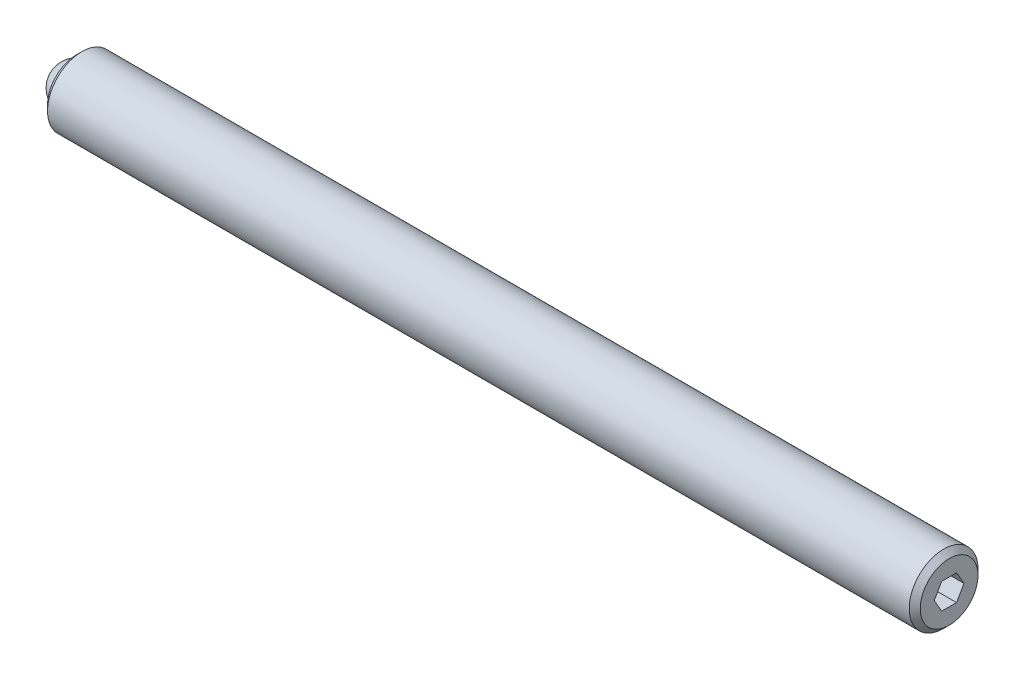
from build123d import *

# Parameters (mm, degrees)
SKETCH2_R           = 3.175
BOSS_EXTRUDE1_DEPTH = 80.565625
CHAMFER1_SIZE       = 0.508
CHAMFER2_SIZE       = 0.508
CUT_EXTRUDE2_DEPTH  = 2.286
SKETCH3_R           = 1.9812
CUT_EXTRUDE3_DEPTH  = 1.984375


with BuildPart() as part:
    # Sketch2 → Boss-Extrude1 (new body)
    with BuildSketch(Plane(origin=(0, 0, 0), x_dir=(0, 0, -1), z_dir=(1, 0, 0))):
        Circle(SKETCH2_R)
    extrude(amount=BOSS_EXTRUDE1_DEPTH)

    # Chamfer1
    chamfer1_edges = [part.edges().sort_by_distance(p)[0] for p in [
        (0, 0, 3.175),
    ]]
    chamfer(chamfer1_edges, length=CHAMFER1_SIZE)

    # Chamfer2
    chamfer2_edges = [part.edges().sort_by_distance(p)[0] for p in [
        (80.565625, 0, 3.175),
    ]]
    chamfer(chamfer2_edges, length=CHAMFER2_SIZE)

    # Sketch4 → Cut-Extrude2 (cut)
    with BuildSketch(Plane(origin=(80.565625, 0, 0), x_dir=(0, 0, -1), z_dir=(1, 0, 0))):
        Polygon((1.374815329, 0), (0.687407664, 1.190625), (-0.687407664, 1.190625), (-1.374815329, 0), (-0.687407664, -1.190625), (0.687407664, -1.190625), align=None)
    extrude(amount=-CUT_EXTRUDE2_DEPTH, mode=Mode.SUBTRACT)

    # Sketch3 → Cut-Extrude3 (cut)
    with BuildSketch(Plane.ZY):
        Circle(SKETCH3_R)
    extrude(amount=-CUT_EXTRUDE3_DEPTH, mode=Mode.SUBTRACT)


with BuildPart() as body_2:
    # Sketch5 → Revolve1 (revolve)
    with BuildSketch(Plane.ZY):
        with BuildLine():
            Line((0, 0), (0, -1.984375))
            ThreePointArc((0, -1.984375), (-1.984375, 0), (0, 1.984375))
            Line((0, 1.984375), (0, 0))
        make_face()
    revolve(axis=Axis((0, 0, 0), (0, 1, 0)))


solid = Compound([part.part, body_2.part])
